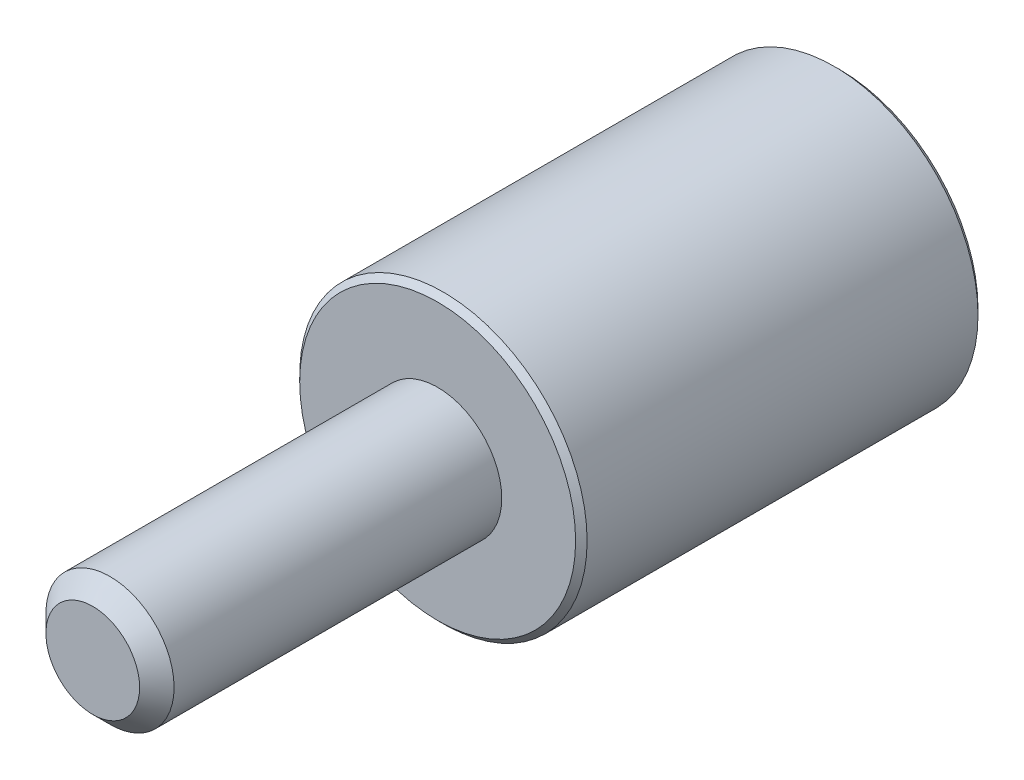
ISO-10303-21;
HEADER;
FILE_DESCRIPTION(('STEP AP214'),'2;1');
FILE_NAME('part.step','',(''),(''),'','','');
FILE_SCHEMA(('AUTOMOTIVE_DESIGN { 1 0 10303 214 1 1 1 1 }'));
ENDSEC;
DATA;
#1=APPLICATION_CONTEXT('core data for automotive mechanical design processes');
#2=APPLICATION_PROTOCOL_DEFINITION('international standard','automotive_design',2000,#1);
#3=PRODUCT_CONTEXT('',#1,'mechanical');
#4=PRODUCT('Part','Part','',(#3));
#5=PRODUCT_RELATED_PRODUCT_CATEGORY('part','',(#4));
#6=PRODUCT_DEFINITION_FORMATION('','',#4);
#7=PRODUCT_DEFINITION_CONTEXT('part definition',#1,'design');
#8=PRODUCT_DEFINITION('design','',#6,#7);
#9=PRODUCT_DEFINITION_SHAPE('','',#8);
#10=(LENGTH_UNIT() NAMED_UNIT(*) SI_UNIT(.MILLI.,.METRE.));
#11=(NAMED_UNIT(*) PLANE_ANGLE_UNIT() SI_UNIT($,.RADIAN.));
#12=(NAMED_UNIT(*) SI_UNIT($,.STERADIAN.) SOLID_ANGLE_UNIT());
#13=UNCERTAINTY_MEASURE_WITH_UNIT(LENGTH_MEASURE(1.E-05),#10,'distance_accuracy_value','');
#14=(GEOMETRIC_REPRESENTATION_CONTEXT(3) GLOBAL_UNCERTAINTY_ASSIGNED_CONTEXT((#13)) GLOBAL_UNIT_ASSIGNED_CONTEXT((#10,
#11,#12)) REPRESENTATION_CONTEXT('',''));
#15=CARTESIAN_POINT('',(0.,0.,0.));
#16=DIRECTION('',(0.,0.,1.));
#17=DIRECTION('',(1.,0.,0.));
#18=AXIS2_PLACEMENT_3D('',#15,#16,#17);
#19=CARTESIAN_POINT('',(0.,0.,0.));
#20=DIRECTION('',(0.,0.,1.));
#21=DIRECTION('',(1.,0.,0.));
#22=AXIS2_PLACEMENT_3D('',#19,#20,#21);
#23=PLANE('',#22);
#24=CARTESIAN_POINT('',(0.,0.,0.));
#25=DIRECTION('',(0.,0.,1.));
#26=DIRECTION('',(1.,0.,0.));
#27=AXIS2_PLACEMENT_3D('',#24,#25,#26);
#28=CIRCLE('',#27,7.45);
#29=CARTESIAN_POINT('',(7.45,0.,0.));
#30=VERTEX_POINT('',#29);
#31=EDGE_CURVE('E47',#30,#30,#28,.T.);
#32=ORIENTED_EDGE('',*,*,#31,.T.);
#33=EDGE_LOOP('',(#32));
#34=FACE_BOUND('',#33,.T.);
#35=CARTESIAN_POINT('',(0.,0.,0.));
#36=DIRECTION('',(0.,0.,1.));
#37=DIRECTION('',(1.,0.,0.));
#38=AXIS2_PLACEMENT_3D('',#35,#36,#37);
#39=CIRCLE('',#38,12.);
#40=CARTESIAN_POINT('',(12.,0.,0.));
#41=VERTEX_POINT('',#40);
#42=EDGE_CURVE('E57',#41,#41,#39,.F.);
#43=ORIENTED_EDGE('',*,*,#42,.T.);
#44=EDGE_LOOP('',(#43));
#45=FACE_BOUND('',#44,.T.);
#46=ADVANCED_FACE('F38',(#34,#45),#23,.F.);
#47=CARTESIAN_POINT('',(0.,0.,30.));
#48=DIRECTION('',(0.,0.,-1.));
#49=DIRECTION('',(-1.,0.,0.));
#50=AXIS2_PLACEMENT_3D('',#47,#48,#49);
#51=CYLINDRICAL_SURFACE('',#50,12.5);
#52=CARTESIAN_POINT('',(0.,0.,0.499999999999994));
#53=DIRECTION('',(0.,0.,1.));
#54=DIRECTION('',(1.,0.,0.));
#55=AXIS2_PLACEMENT_3D('',#52,#53,#54);
#56=CIRCLE('',#55,12.5);
#57=CARTESIAN_POINT('',(12.5,0.,0.499999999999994));
#58=VERTEX_POINT('',#57);
#59=EDGE_CURVE('E63',#58,#58,#56,.T.);
#60=ORIENTED_EDGE('',*,*,#59,.T.);
#61=EDGE_LOOP('',(#60));
#62=FACE_BOUND('',#61,.T.);
#63=CARTESIAN_POINT('',(0.,0.,34.5));
#64=DIRECTION('',(0.,0.,1.));
#65=DIRECTION('',(1.,0.,0.));
#66=AXIS2_PLACEMENT_3D('',#63,#64,#65);
#67=CIRCLE('',#66,12.5);
#68=CARTESIAN_POINT('',(12.5,0.,34.5));
#69=VERTEX_POINT('',#68);
#70=EDGE_CURVE('E67',#69,#69,#67,.F.);
#71=ORIENTED_EDGE('',*,*,#70,.T.);
#72=EDGE_LOOP('',(#71));
#73=FACE_BOUND('',#72,.T.);
#74=ADVANCED_FACE('F106',(#62,#73),#51,.T.);
#75=CARTESIAN_POINT('',(0.,0.,30.));
#76=DIRECTION('',(0.,0.,-1.));
#77=DIRECTION('',(-1.,0.,0.));
#78=AXIS2_PLACEMENT_3D('',#75,#76,#77);
#79=CYLINDRICAL_SURFACE('',#78,6.45);
#80=CARTESIAN_POINT('',(0.,0.,1.));
#81=DIRECTION('',(0.,0.,1.));
#82=DIRECTION('',(1.,0.,0.));
#83=AXIS2_PLACEMENT_3D('',#80,#81,#82);
#84=CIRCLE('',#83,6.45);
#85=CARTESIAN_POINT('',(6.45,0.,1.));
#86=VERTEX_POINT('',#85);
#87=EDGE_CURVE('E10',#86,#86,#84,.F.);
#88=ORIENTED_EDGE('',*,*,#87,.T.);
#89=EDGE_LOOP('',(#88));
#90=FACE_BOUND('',#89,.T.);
#91=CARTESIAN_POINT('',(0.,0.,30.));
#92=DIRECTION('',(0.,0.,1.));
#93=DIRECTION('',(1.,0.,0.));
#94=AXIS2_PLACEMENT_3D('',#91,#92,#93);
#95=CIRCLE('',#94,6.45);
#96=CARTESIAN_POINT('',(6.45,0.,30.));
#97=VERTEX_POINT('',#96);
#98=EDGE_CURVE('E80',#97,#97,#95,.T.);
#99=ORIENTED_EDGE('',*,*,#98,.T.);
#100=EDGE_LOOP('',(#99));
#101=FACE_BOUND('',#100,.T.);
#102=ADVANCED_FACE('F102',(#90,#101),#79,.F.);
#103=CARTESIAN_POINT('',(0.,0.,30.));
#104=DIRECTION('',(0.,0.,1.));
#105=DIRECTION('',(1.,0.,0.));
#106=AXIS2_PLACEMENT_3D('',#103,#104,#105);
#107=PLANE('',#106);
#108=ORIENTED_EDGE('',*,*,#98,.F.);
#109=EDGE_LOOP('',(#108));
#110=FACE_BOUND('',#109,.T.);
#111=ADVANCED_FACE('F92',(#110),#107,.F.);
#112=CARTESIAN_POINT('',(0.,0.,35.));
#113=DIRECTION('',(0.,0.,1.));
#114=DIRECTION('',(1.,0.,0.));
#115=AXIS2_PLACEMENT_3D('',#112,#113,#114);
#116=PLANE('',#115);
#117=CARTESIAN_POINT('',(0.,0.,35.));
#118=DIRECTION('',(0.,0.,1.));
#119=DIRECTION('',(1.,0.,0.));
#120=AXIS2_PLACEMENT_3D('',#117,#118,#119);
#121=CIRCLE('',#120,12.);
#122=CARTESIAN_POINT('',(12.,0.,35.));
#123=VERTEX_POINT('',#122);
#124=EDGE_CURVE('E52',#123,#123,#121,.T.);
#125=ORIENTED_EDGE('',*,*,#124,.T.);
#126=EDGE_LOOP('',(#125));
#127=FACE_BOUND('',#126,.T.);
#128=CARTESIAN_POINT('',(0.,0.,35.));
#129=DIRECTION('',(0.,0.,1.));
#130=DIRECTION('',(1.,0.,0.));
#131=AXIS2_PLACEMENT_3D('',#128,#129,#130);
#132=CIRCLE('',#131,5.575);
#133=CARTESIAN_POINT('',(5.575,0.,35.));
#134=VERTEX_POINT('',#133);
#135=EDGE_CURVE('E79',#134,#134,#132,.T.);
#136=ORIENTED_EDGE('',*,*,#135,.F.);
#137=EDGE_LOOP('',(#136));
#138=FACE_BOUND('',#137,.T.);
#139=ADVANCED_FACE('F90',(#127,#138),#116,.T.);
#140=CARTESIAN_POINT('',(0.,0.,65.));
#141=DIRECTION('',(0.,0.,-1.));
#142=DIRECTION('',(-1.,0.,0.));
#143=AXIS2_PLACEMENT_3D('',#140,#141,#142);
#144=CYLINDRICAL_SURFACE('',#143,5.575);
#145=CARTESIAN_POINT('',(0.,0.,63.5));
#146=DIRECTION('',(0.,0.,1.));
#147=DIRECTION('',(1.,0.,0.));
#148=AXIS2_PLACEMENT_3D('',#145,#146,#147);
#149=CIRCLE('',#148,5.575);
#150=CARTESIAN_POINT('',(5.575,0.,63.5));
#151=VERTEX_POINT('',#150);
#152=EDGE_CURVE('E71',#151,#151,#149,.F.);
#153=ORIENTED_EDGE('',*,*,#152,.T.);
#154=EDGE_LOOP('',(#153));
#155=FACE_BOUND('',#154,.T.);
#156=ORIENTED_EDGE('',*,*,#135,.T.);
#157=EDGE_LOOP('',(#156));
#158=FACE_BOUND('',#157,.T.);
#159=ADVANCED_FACE('F88',(#155,#158),#144,.T.);
#160=CARTESIAN_POINT('',(0.,0.,65.));
#161=DIRECTION('',(0.,0.,1.));
#162=DIRECTION('',(1.,0.,0.));
#163=AXIS2_PLACEMENT_3D('',#160,#161,#162);
#164=PLANE('',#163);
#165=CARTESIAN_POINT('',(0.,0.,65.));
#166=DIRECTION('',(0.,0.,1.));
#167=DIRECTION('',(1.,0.,0.));
#168=AXIS2_PLACEMENT_3D('',#165,#166,#167);
#169=CIRCLE('',#168,4.075);
#170=CARTESIAN_POINT('',(4.075,0.,65.));
#171=VERTEX_POINT('',#170);
#172=EDGE_CURVE('E75',#171,#171,#169,.T.);
#173=ORIENTED_EDGE('',*,*,#172,.T.);
#174=EDGE_LOOP('',(#173));
#175=FACE_BOUND('',#174,.T.);
#176=ADVANCED_FACE('F99',(#175),#164,.T.);
#177=CARTESIAN_POINT('',(0.,0.,65.));
#178=DIRECTION('',(0.,0.,-1.));
#179=DIRECTION('',(-1.,0.,0.));
#180=AXIS2_PLACEMENT_3D('',#177,#178,#179);
#181=CONICAL_SURFACE('',#180,4.075,0.785398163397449);
#182=ORIENTED_EDGE('',*,*,#152,.F.);
#183=EDGE_LOOP('',(#182));
#184=FACE_BOUND('',#183,.T.);
#185=ORIENTED_EDGE('',*,*,#172,.F.);
#186=EDGE_LOOP('',(#185));
#187=FACE_BOUND('',#186,.T.);
#188=ADVANCED_FACE('F119',(#184,#187),#181,.T.);
#189=CARTESIAN_POINT('',(0.,0.,0.499999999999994));
#190=DIRECTION('',(0.,0.,1.));
#191=DIRECTION('',(1.,0.,0.));
#192=AXIS2_PLACEMENT_3D('',#189,#190,#191);
#193=CONICAL_SURFACE('',#192,12.5,0.785398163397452);
#194=ORIENTED_EDGE('',*,*,#42,.F.);
#195=EDGE_LOOP('',(#194));
#196=FACE_BOUND('',#195,.T.);
#197=ORIENTED_EDGE('',*,*,#59,.F.);
#198=EDGE_LOOP('',(#197));
#199=FACE_BOUND('',#198,.T.);
#200=ADVANCED_FACE('F125',(#196,#199),#193,.T.);
#201=CARTESIAN_POINT('',(0.,0.,35.));
#202=DIRECTION('',(0.,0.,-1.));
#203=DIRECTION('',(-1.,0.,0.));
#204=AXIS2_PLACEMENT_3D('',#201,#202,#203);
#205=CONICAL_SURFACE('',#204,12.,0.785398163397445);
#206=ORIENTED_EDGE('',*,*,#70,.F.);
#207=EDGE_LOOP('',(#206));
#208=FACE_BOUND('',#207,.T.);
#209=ORIENTED_EDGE('',*,*,#124,.F.);
#210=EDGE_LOOP('',(#209));
#211=FACE_BOUND('',#210,.T.);
#212=ADVANCED_FACE('F131',(#208,#211),#205,.T.);
#213=CARTESIAN_POINT('',(0.,0.,0.));
#214=DIRECTION('',(0.,0.,-1.));
#215=DIRECTION('',(-1.,0.,0.));
#216=AXIS2_PLACEMENT_3D('',#213,#214,#215);
#217=CONICAL_SURFACE('',#216,7.45,0.785398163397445);
#218=ORIENTED_EDGE('',*,*,#87,.F.);
#219=EDGE_LOOP('',(#218));
#220=FACE_BOUND('',#219,.T.);
#221=ORIENTED_EDGE('',*,*,#31,.F.);
#222=EDGE_LOOP('',(#221));
#223=FACE_BOUND('',#222,.T.);
#224=ADVANCED_FACE('F41',(#220,#223),#217,.F.);
#225=CLOSED_SHELL('',(#46,#74,#102,#111,#139,#159,#176,#188,#200,#212,#224));
#226=MANIFOLD_SOLID_BREP('B2',#225);
#227=ADVANCED_BREP_SHAPE_REPRESENTATION('',(#18,#226),#14);
#228=SHAPE_DEFINITION_REPRESENTATION(#9,#227);
ENDSEC;
END-ISO-10303-21;
